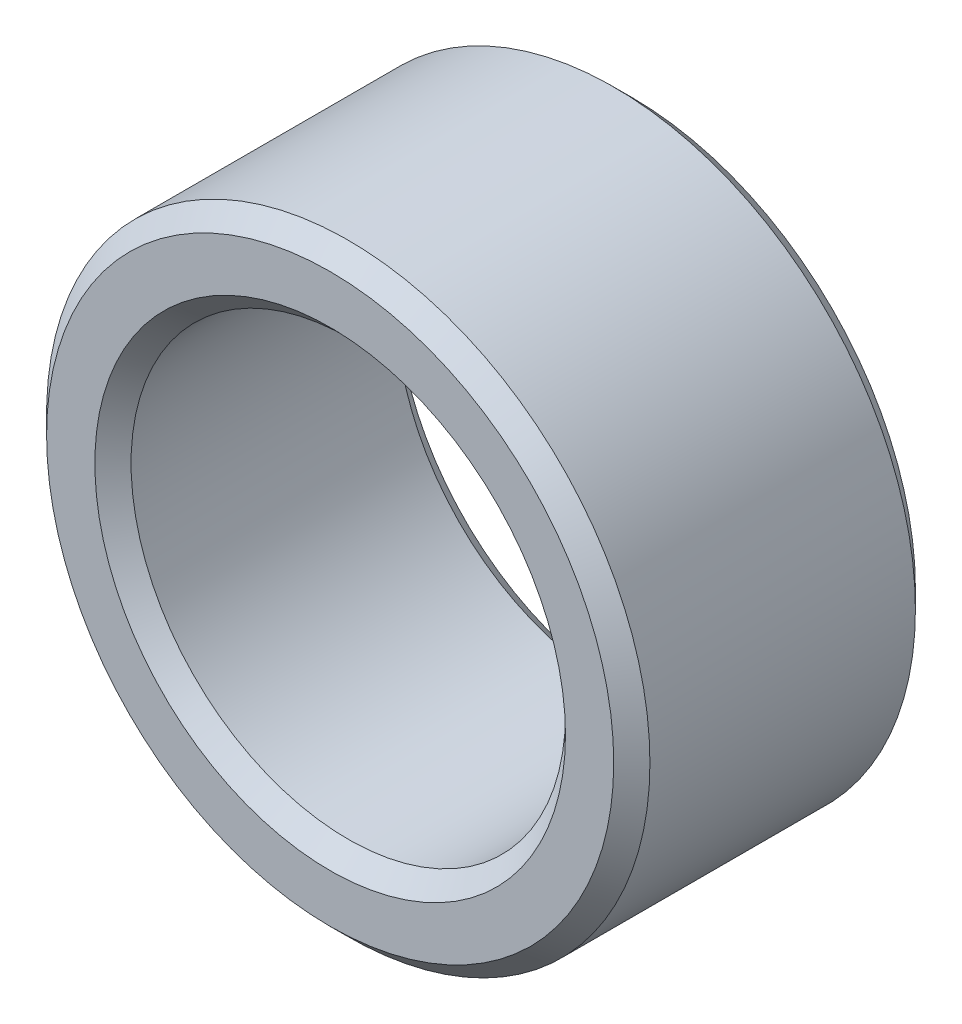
ISO-10303-21;
HEADER;
FILE_DESCRIPTION(('STEP AP214'),'2;1');
FILE_NAME('part.step','',(''),(''),'','','');
FILE_SCHEMA(('AUTOMOTIVE_DESIGN { 1 0 10303 214 1 1 1 1 }'));
ENDSEC;
DATA;
#1=APPLICATION_CONTEXT('core data for automotive mechanical design processes');
#2=APPLICATION_PROTOCOL_DEFINITION('international standard','automotive_design',2000,#1);
#3=PRODUCT_CONTEXT('',#1,'mechanical');
#4=PRODUCT('Part','Part','',(#3));
#5=PRODUCT_RELATED_PRODUCT_CATEGORY('part','',(#4));
#6=PRODUCT_DEFINITION_FORMATION('','',#4);
#7=PRODUCT_DEFINITION_CONTEXT('part definition',#1,'design');
#8=PRODUCT_DEFINITION('design','',#6,#7);
#9=PRODUCT_DEFINITION_SHAPE('','',#8);
#10=(LENGTH_UNIT() NAMED_UNIT(*) SI_UNIT(.MILLI.,.METRE.));
#11=(NAMED_UNIT(*) PLANE_ANGLE_UNIT() SI_UNIT($,.RADIAN.));
#12=(NAMED_UNIT(*) SI_UNIT($,.STERADIAN.) SOLID_ANGLE_UNIT());
#13=UNCERTAINTY_MEASURE_WITH_UNIT(LENGTH_MEASURE(1.E-05),#10,'distance_accuracy_value','');
#14=(GEOMETRIC_REPRESENTATION_CONTEXT(3) GLOBAL_UNCERTAINTY_ASSIGNED_CONTEXT((#13)) GLOBAL_UNIT_ASSIGNED_CONTEXT((#10,
#11,#12)) REPRESENTATION_CONTEXT('',''));
#15=CARTESIAN_POINT('',(0.,0.,0.));
#16=DIRECTION('',(0.,0.,1.));
#17=DIRECTION('',(1.,0.,0.));
#18=AXIS2_PLACEMENT_3D('',#15,#16,#17);
#19=CARTESIAN_POINT('',(0.,0.,-0.79375));
#20=DIRECTION('',(0.,0.,1.));
#21=DIRECTION('',(1.,0.,0.));
#22=AXIS2_PLACEMENT_3D('',#19,#20,#21);
#23=CYLINDRICAL_SURFACE('',#22,1.5875);
#24=CARTESIAN_POINT('',(0.,0.,-0.6985));
#25=DIRECTION('',(0.,0.,1.));
#26=DIRECTION('',(1.,0.,0.));
#27=AXIS2_PLACEMENT_3D('',#24,#25,#26);
#28=CIRCLE('',#27,1.5875);
#29=CARTESIAN_POINT('',(1.5875,0.,-0.6985));
#30=VERTEX_POINT('',#29);
#31=EDGE_CURVE('E10',#30,#30,#28,.T.);
#32=ORIENTED_EDGE('',*,*,#31,.T.);
#33=EDGE_LOOP('',(#32));
#34=FACE_BOUND('',#33,.T.);
#35=CARTESIAN_POINT('',(0.,0.,0.6985));
#36=DIRECTION('',(0.,0.,1.));
#37=DIRECTION('',(1.,0.,0.));
#38=AXIS2_PLACEMENT_3D('',#35,#36,#37);
#39=CIRCLE('',#38,1.5875);
#40=CARTESIAN_POINT('',(1.5875,0.,0.6985));
#41=VERTEX_POINT('',#40);
#42=EDGE_CURVE('E41',#41,#41,#39,.F.);
#43=ORIENTED_EDGE('',*,*,#42,.T.);
#44=EDGE_LOOP('',(#43));
#45=FACE_BOUND('',#44,.T.);
#46=ADVANCED_FACE('F34',(#34,#45),#23,.T.);
#47=CARTESIAN_POINT('',(0.,0.,-0.79375));
#48=DIRECTION('',(0.,0.,1.));
#49=DIRECTION('',(1.,0.,0.));
#50=AXIS2_PLACEMENT_3D('',#47,#48,#49);
#51=PLANE('',#50);
#52=CARTESIAN_POINT('',(0.,0.,-0.79375));
#53=DIRECTION('',(0.,0.,1.));
#54=DIRECTION('',(1.,0.,0.));
#55=AXIS2_PLACEMENT_3D('',#52,#53,#54);
#56=CIRCLE('',#55,1.23825);
#57=CARTESIAN_POINT('',(1.23825,0.,-0.79375));
#58=VERTEX_POINT('',#57);
#59=EDGE_CURVE('E60',#58,#58,#56,.T.);
#60=ORIENTED_EDGE('',*,*,#59,.T.);
#61=EDGE_LOOP('',(#60));
#62=FACE_BOUND('',#61,.T.);
#63=CARTESIAN_POINT('',(0.,0.,-0.79375));
#64=DIRECTION('',(0.,0.,1.));
#65=DIRECTION('',(1.,0.,0.));
#66=AXIS2_PLACEMENT_3D('',#63,#64,#65);
#67=CIRCLE('',#66,1.49225);
#68=CARTESIAN_POINT('',(1.49225,0.,-0.79375));
#69=VERTEX_POINT('',#68);
#70=EDGE_CURVE('E63',#69,#69,#67,.F.);
#71=ORIENTED_EDGE('',*,*,#70,.T.);
#72=EDGE_LOOP('',(#71));
#73=FACE_BOUND('',#72,.T.);
#74=ADVANCED_FACE('F67',(#62,#73),#51,.F.);
#75=CARTESIAN_POINT('',(0.,0.,-0.79375));
#76=DIRECTION('',(0.,0.,1.));
#77=DIRECTION('',(1.,0.,0.));
#78=AXIS2_PLACEMENT_3D('',#75,#76,#77);
#79=CYLINDRICAL_SURFACE('',#78,1.143);
#80=CARTESIAN_POINT('',(0.,0.,-0.6985));
#81=DIRECTION('',(0.,0.,1.));
#82=DIRECTION('',(1.,0.,0.));
#83=AXIS2_PLACEMENT_3D('',#80,#81,#82);
#84=CIRCLE('',#83,1.143);
#85=CARTESIAN_POINT('',(1.143,0.,-0.6985));
#86=VERTEX_POINT('',#85);
#87=EDGE_CURVE('E54',#86,#86,#84,.F.);
#88=ORIENTED_EDGE('',*,*,#87,.T.);
#89=EDGE_LOOP('',(#88));
#90=FACE_BOUND('',#89,.T.);
#91=CARTESIAN_POINT('',(0.,0.,0.6985));
#92=DIRECTION('',(0.,0.,1.));
#93=DIRECTION('',(1.,0.,0.));
#94=AXIS2_PLACEMENT_3D('',#91,#92,#93);
#95=CIRCLE('',#94,1.143);
#96=CARTESIAN_POINT('',(1.143,0.,0.6985));
#97=VERTEX_POINT('',#96);
#98=EDGE_CURVE('E57',#97,#97,#95,.T.);
#99=ORIENTED_EDGE('',*,*,#98,.T.);
#100=EDGE_LOOP('',(#99));
#101=FACE_BOUND('',#100,.T.);
#102=ADVANCED_FACE('F86',(#90,#101),#79,.F.);
#103=CARTESIAN_POINT('',(0.,0.,0.79375));
#104=DIRECTION('',(0.,0.,1.));
#105=DIRECTION('',(1.,0.,0.));
#106=AXIS2_PLACEMENT_3D('',#103,#104,#105);
#107=PLANE('',#106);
#108=CARTESIAN_POINT('',(0.,0.,0.79375));
#109=DIRECTION('',(0.,0.,1.));
#110=DIRECTION('',(1.,0.,0.));
#111=AXIS2_PLACEMENT_3D('',#108,#109,#110);
#112=CIRCLE('',#111,1.23825);
#113=CARTESIAN_POINT('',(1.23825,0.,0.79375));
#114=VERTEX_POINT('',#113);
#115=EDGE_CURVE('E45',#114,#114,#112,.F.);
#116=ORIENTED_EDGE('',*,*,#115,.T.);
#117=EDGE_LOOP('',(#116));
#118=FACE_BOUND('',#117,.T.);
#119=CARTESIAN_POINT('',(0.,0.,0.79375));
#120=DIRECTION('',(0.,0.,1.));
#121=DIRECTION('',(1.,0.,0.));
#122=AXIS2_PLACEMENT_3D('',#119,#120,#121);
#123=CIRCLE('',#122,1.49225);
#124=CARTESIAN_POINT('',(1.49225,0.,0.79375));
#125=VERTEX_POINT('',#124);
#126=EDGE_CURVE('E49',#125,#125,#123,.T.);
#127=ORIENTED_EDGE('',*,*,#126,.T.);
#128=EDGE_LOOP('',(#127));
#129=FACE_BOUND('',#128,.T.);
#130=ADVANCED_FACE('F92',(#118,#129),#107,.T.);
#131=CARTESIAN_POINT('',(0.,0.,-0.79375));
#132=DIRECTION('',(0.,0.,-1.));
#133=DIRECTION('',(-1.,0.,0.));
#134=AXIS2_PLACEMENT_3D('',#131,#132,#133);
#135=CONICAL_SURFACE('',#134,1.23825,0.785398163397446);
#136=ORIENTED_EDGE('',*,*,#87,.F.);
#137=EDGE_LOOP('',(#136));
#138=FACE_BOUND('',#137,.T.);
#139=ORIENTED_EDGE('',*,*,#59,.F.);
#140=EDGE_LOOP('',(#139));
#141=FACE_BOUND('',#140,.T.);
#142=ADVANCED_FACE('F78',(#138,#141),#135,.F.);
#143=CARTESIAN_POINT('',(0.,0.,0.6985));
#144=DIRECTION('',(0.,0.,1.));
#145=DIRECTION('',(1.,0.,0.));
#146=AXIS2_PLACEMENT_3D('',#143,#144,#145);
#147=CONICAL_SURFACE('',#146,1.143,0.785398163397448);
#148=ORIENTED_EDGE('',*,*,#115,.F.);
#149=EDGE_LOOP('',(#148));
#150=FACE_BOUND('',#149,.T.);
#151=ORIENTED_EDGE('',*,*,#98,.F.);
#152=EDGE_LOOP('',(#151));
#153=FACE_BOUND('',#152,.T.);
#154=ADVANCED_FACE('F72',(#150,#153),#147,.F.);
#155=CARTESIAN_POINT('',(0.,0.,-0.6985));
#156=DIRECTION('',(0.,0.,1.));
#157=DIRECTION('',(1.,0.,0.));
#158=AXIS2_PLACEMENT_3D('',#155,#156,#157);
#159=CONICAL_SURFACE('',#158,1.5875,0.785398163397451);
#160=ORIENTED_EDGE('',*,*,#70,.F.);
#161=EDGE_LOOP('',(#160));
#162=FACE_BOUND('',#161,.T.);
#163=ORIENTED_EDGE('',*,*,#31,.F.);
#164=EDGE_LOOP('',(#163));
#165=FACE_BOUND('',#164,.T.);
#166=ADVANCED_FACE('F69',(#162,#165),#159,.T.);
#167=CARTESIAN_POINT('',(0.,0.,0.79375));
#168=DIRECTION('',(0.,0.,-1.));
#169=DIRECTION('',(-1.,0.,0.));
#170=AXIS2_PLACEMENT_3D('',#167,#168,#169);
#171=CONICAL_SURFACE('',#170,1.49225,0.785398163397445);
#172=ORIENTED_EDGE('',*,*,#42,.F.);
#173=EDGE_LOOP('',(#172));
#174=FACE_BOUND('',#173,.T.);
#175=ORIENTED_EDGE('',*,*,#126,.F.);
#176=EDGE_LOOP('',(#175));
#177=FACE_BOUND('',#176,.T.);
#178=ADVANCED_FACE('F36',(#174,#177),#171,.T.);
#179=CLOSED_SHELL('',(#46,#74,#102,#130,#142,#154,#166,#178));
#180=MANIFOLD_SOLID_BREP('B2',#179);
#181=ADVANCED_BREP_SHAPE_REPRESENTATION('',(#18,#180),#14);
#182=SHAPE_DEFINITION_REPRESENTATION(#9,#181);
ENDSEC;
END-ISO-10303-21;
